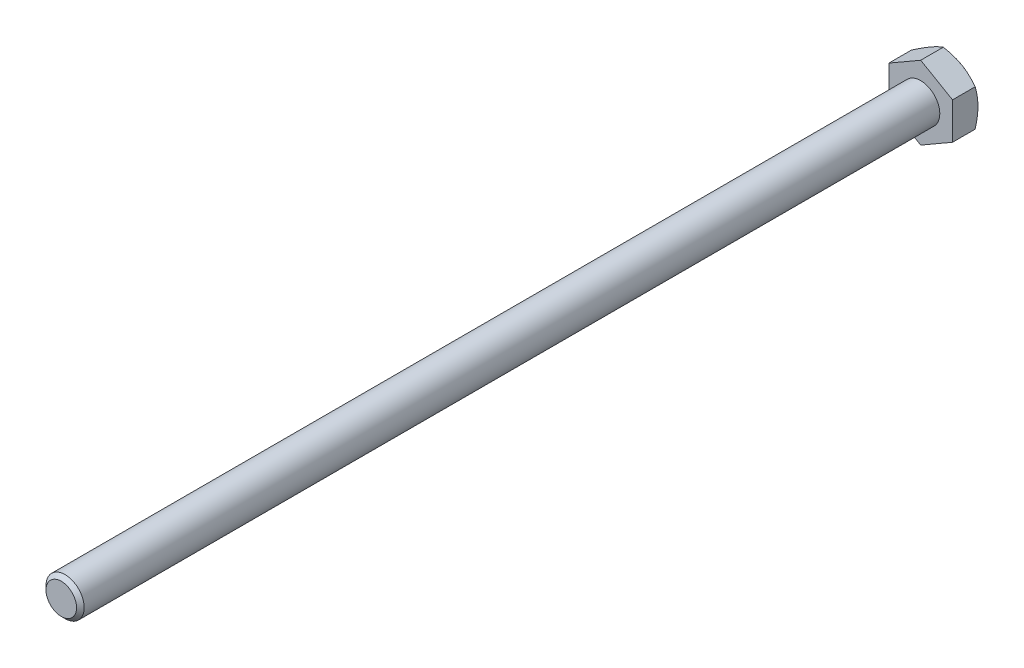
from build123d import *

# Parameters (mm, degrees)
ESQUISSE1_W        = 3
ESQUISSE1_H        = 135
CHANFREIN1_SIZE    = 0.6
BOSS_EXTRU_1_DEPTH = 4


with BuildPart() as part:
    # Esquisse1 → Base-R_volution (revolve)
    with BuildSketch(Plane(origin=(0, 0, 0), x_dir=(1, 0, 0), z_dir=(0, 1, 0))):
        with Locations((1.5, -67.5)):
            Rectangle(ESQUISSE1_W, ESQUISSE1_H)
    revolve(axis=Axis((0, 0, 0), (0, 0, 1)))

    # Chanfrein1
    chanfrein1_edges = [part.edges().sort_by_distance(p)[0] for p in [
        (-3, 0, 135),
    ]]
    chamfer(chanfrein1_edges, length=CHANFREIN1_SIZE)

    # Esquisse6 → Boss.-Extru.1 (add)
    with BuildSketch(Plane.XY):
        Polygon((5, -2.886751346), (5, 2.886751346), (0, 5.773502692), (-5, 2.886751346), (-5, -2.886751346), (0, -5.773502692), align=None)
    extrude(amount=-BOSS_EXTRU_1_DEPTH)

    # Esquisse7 → Enl_vement de mati_re-R_volution1 (revolve, cut)
    with BuildSketch(Plane(origin=(0, 0, 0), x_dir=(1, 0, 0), z_dir=(0, 1, 0))):
        Polygon((-5, 4), (-11.92820323, 4), (-11.92820323, 0), align=None)
    revolve(axis=Axis((0, 0, -6.239446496), (0, 0, 1)), mode=Mode.SUBTRACT)


solid = part.part
